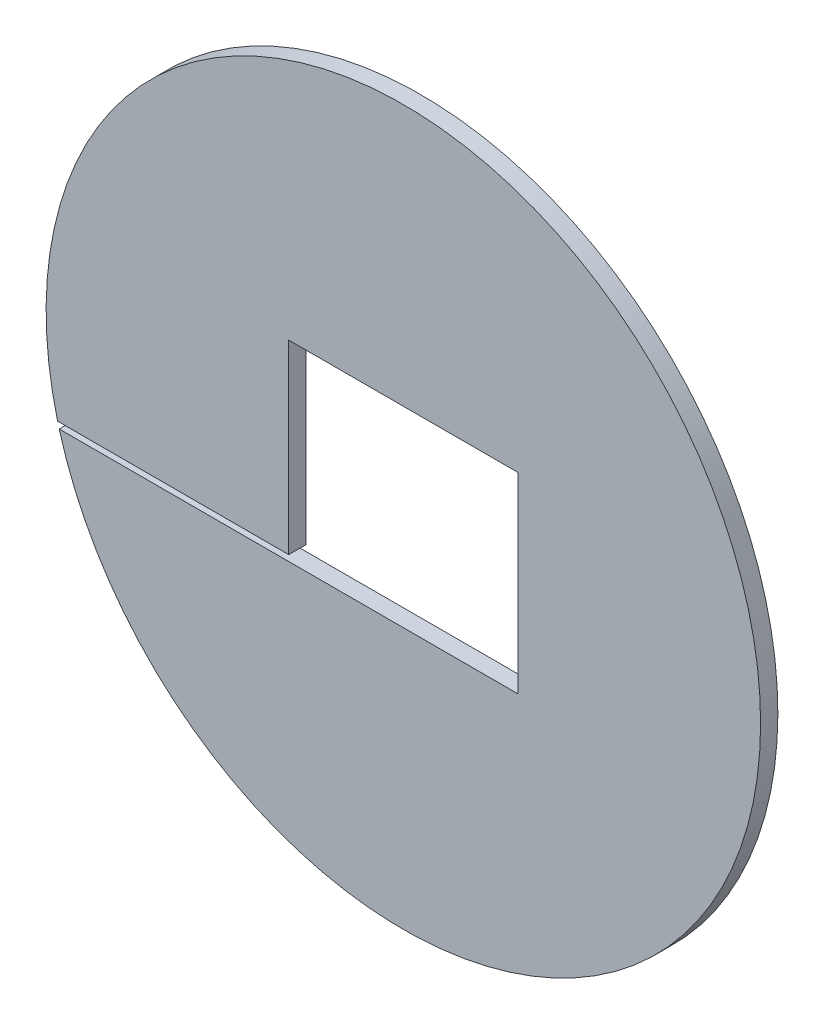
ISO-10303-21;
HEADER;
FILE_DESCRIPTION(('STEP AP214'),'2;1');
FILE_NAME('part.step','',(''),(''),'','','');
FILE_SCHEMA(('AUTOMOTIVE_DESIGN { 1 0 10303 214 1 1 1 1 }'));
ENDSEC;
DATA;
#1=APPLICATION_CONTEXT('core data for automotive mechanical design processes');
#2=APPLICATION_PROTOCOL_DEFINITION('international standard','automotive_design',2000,#1);
#3=PRODUCT_CONTEXT('',#1,'mechanical');
#4=PRODUCT('Part','Part','',(#3));
#5=PRODUCT_RELATED_PRODUCT_CATEGORY('part','',(#4));
#6=PRODUCT_DEFINITION_FORMATION('','',#4);
#7=PRODUCT_DEFINITION_CONTEXT('part definition',#1,'design');
#8=PRODUCT_DEFINITION('design','',#6,#7);
#9=PRODUCT_DEFINITION_SHAPE('','',#8);
#10=(LENGTH_UNIT() NAMED_UNIT(*) SI_UNIT(.MILLI.,.METRE.));
#11=(NAMED_UNIT(*) PLANE_ANGLE_UNIT() SI_UNIT($,.RADIAN.));
#12=(NAMED_UNIT(*) SI_UNIT($,.STERADIAN.) SOLID_ANGLE_UNIT());
#13=UNCERTAINTY_MEASURE_WITH_UNIT(LENGTH_MEASURE(1.E-05),#10,'distance_accuracy_value','');
#14=(GEOMETRIC_REPRESENTATION_CONTEXT(3) GLOBAL_UNCERTAINTY_ASSIGNED_CONTEXT((#13)) GLOBAL_UNIT_ASSIGNED_CONTEXT((#10,
#11,#12)) REPRESENTATION_CONTEXT('',''));
#15=CARTESIAN_POINT('',(0.,0.,0.));
#16=DIRECTION('',(0.,0.,1.));
#17=DIRECTION('',(1.,0.,0.));
#18=AXIS2_PLACEMENT_3D('',#15,#16,#17);
#19=CARTESIAN_POINT('',(0.,0.,0.7366));
#20=DIRECTION('',(0.,0.,-1.));
#21=DIRECTION('',(-1.,0.,0.));
#22=AXIS2_PLACEMENT_3D('',#19,#20,#21);
#23=CYLINDRICAL_SURFACE('',#22,15.24);
#24=DIRECTION('',(0.,0.,1.));
#25=VECTOR('',#24,1.);
#26=CARTESIAN_POINT('',(-14.7494849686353,-3.8354,0.7366));
#27=LINE('',#26,#25);
#28=CARTESIAN_POINT('',(-14.7494849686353,-3.8354,0.7366));
#29=VERTEX_POINT('',#28);
#30=CARTESIAN_POINT('',(-14.7494849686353,-3.8354,0.));
#31=VERTEX_POINT('',#30);
#32=EDGE_CURVE('E56',#29,#31,#27,.F.);
#33=ORIENTED_EDGE('',*,*,#32,.F.);
#34=CARTESIAN_POINT('',(0.,0.,0.7366));
#35=DIRECTION('',(0.,0.,1.));
#36=DIRECTION('',(1.,0.,0.));
#37=AXIS2_PLACEMENT_3D('',#34,#35,#36);
#38=CIRCLE('',#37,15.24);
#39=CARTESIAN_POINT('',(-14.6810901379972,-4.0894,0.7366));
#40=VERTEX_POINT('',#39);
#41=EDGE_CURVE('E11',#40,#29,#38,.T.);
#42=ORIENTED_EDGE('',*,*,#41,.F.);
#43=DIRECTION('',(0.,0.,1.));
#44=VECTOR('',#43,1.);
#45=CARTESIAN_POINT('',(-14.6810901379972,-4.0894,0.7366));
#46=LINE('',#45,#44);
#47=CARTESIAN_POINT('',(-14.6810901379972,-4.0894,0.));
#48=VERTEX_POINT('',#47);
#49=EDGE_CURVE('E93',#40,#48,#46,.F.);
#50=ORIENTED_EDGE('',*,*,#49,.T.);
#51=CARTESIAN_POINT('',(0.,0.,0.));
#52=DIRECTION('',(0.,0.,1.));
#53=DIRECTION('',(1.,0.,0.));
#54=AXIS2_PLACEMENT_3D('',#51,#52,#53);
#55=CIRCLE('',#54,15.24);
#56=EDGE_CURVE('E40',#48,#31,#55,.T.);
#57=ORIENTED_EDGE('',*,*,#56,.T.);
#58=EDGE_LOOP('',(#33,#42,#50,#57));
#59=FACE_BOUND('',#58,.T.);
#60=ADVANCED_FACE('F33',(#59),#23,.T.);
#61=CARTESIAN_POINT('',(0.,0.,0.7366));
#62=DIRECTION('',(0.,0.,1.));
#63=DIRECTION('',(1.,0.,0.));
#64=AXIS2_PLACEMENT_3D('',#61,#62,#63);
#65=PLANE('',#64);
#66=ORIENTED_EDGE('',*,*,#41,.T.);
#67=DIRECTION('',(-1.,0.,0.));
#68=VECTOR('',#67,1.);
#69=CARTESIAN_POINT('',(-4.8895,-3.8354,0.7366));
#70=LINE('',#69,#68);
#71=CARTESIAN_POINT('',(-4.8895,-3.8354,0.7366));
#72=VERTEX_POINT('',#71);
#73=EDGE_CURVE('E76',#72,#29,#70,.T.);
#74=ORIENTED_EDGE('',*,*,#73,.F.);
#75=DIRECTION('',(0.,-1.,0.));
#76=VECTOR('',#75,1.);
#77=CARTESIAN_POINT('',(-4.8895,4.0894,0.7366));
#78=LINE('',#77,#76);
#79=CARTESIAN_POINT('',(-4.8895,4.0894,0.7366));
#80=VERTEX_POINT('',#79);
#81=EDGE_CURVE('E83',#80,#72,#78,.T.);
#82=ORIENTED_EDGE('',*,*,#81,.F.);
#83=DIRECTION('',(-1.,0.,0.));
#84=VECTOR('',#83,1.);
#85=CARTESIAN_POINT('',(-4.8895,4.0894,0.7366));
#86=LINE('',#85,#84);
#87=CARTESIAN_POINT('',(4.8895,4.0894,0.7366));
#88=VERTEX_POINT('',#87);
#89=EDGE_CURVE('E139',#88,#80,#86,.T.);
#90=ORIENTED_EDGE('',*,*,#89,.F.);
#91=DIRECTION('',(0.,1.,0.));
#92=VECTOR('',#91,1.);
#93=CARTESIAN_POINT('',(4.8895,4.0894,0.7366));
#94=LINE('',#93,#92);
#95=CARTESIAN_POINT('',(4.8895,-4.0894,0.7366));
#96=VERTEX_POINT('',#95);
#97=EDGE_CURVE('E107',#96,#88,#94,.T.);
#98=ORIENTED_EDGE('',*,*,#97,.F.);
#99=DIRECTION('',(1.,0.,0.));
#100=VECTOR('',#99,1.);
#101=CARTESIAN_POINT('',(-4.8895,-4.0894,0.7366));
#102=LINE('',#101,#100);
#103=EDGE_CURVE('E96',#40,#96,#102,.T.);
#104=ORIENTED_EDGE('',*,*,#103,.F.);
#105=EDGE_LOOP('',(#66,#74,#82,#90,#98,#104));
#106=FACE_BOUND('',#105,.T.);
#107=ADVANCED_FACE('F105',(#106),#65,.T.);
#108=CARTESIAN_POINT('',(0.,0.,0.));
#109=DIRECTION('',(0.,0.,1.));
#110=DIRECTION('',(1.,0.,0.));
#111=AXIS2_PLACEMENT_3D('',#108,#109,#110);
#112=PLANE('',#111);
#113=DIRECTION('',(1.,0.,0.));
#114=VECTOR('',#113,1.);
#115=CARTESIAN_POINT('',(0.,-3.8354,0.));
#116=LINE('',#115,#114);
#117=CARTESIAN_POINT('',(-4.8895,-3.8354,0.));
#118=VERTEX_POINT('',#117);
#119=EDGE_CURVE('E101',#118,#31,#116,.F.);
#120=ORIENTED_EDGE('',*,*,#119,.T.);
#121=ORIENTED_EDGE('',*,*,#56,.F.);
#122=DIRECTION('',(1.,0.,0.));
#123=VECTOR('',#122,1.);
#124=CARTESIAN_POINT('',(0.,-4.0894,0.));
#125=LINE('',#124,#123);
#126=CARTESIAN_POINT('',(4.8895,-4.0894,0.));
#127=VERTEX_POINT('',#126);
#128=EDGE_CURVE('E71',#48,#127,#125,.T.);
#129=ORIENTED_EDGE('',*,*,#128,.T.);
#130=DIRECTION('',(0.,1.,0.));
#131=VECTOR('',#130,1.);
#132=CARTESIAN_POINT('',(4.8895,0.,0.));
#133=LINE('',#132,#131);
#134=CARTESIAN_POINT('',(4.8895,4.0894,0.));
#135=VERTEX_POINT('',#134);
#136=EDGE_CURVE('E125',#127,#135,#133,.T.);
#137=ORIENTED_EDGE('',*,*,#136,.T.);
#138=DIRECTION('',(1.,0.,0.));
#139=VECTOR('',#138,1.);
#140=CARTESIAN_POINT('',(0.,4.0894,0.));
#141=LINE('',#140,#139);
#142=CARTESIAN_POINT('',(-4.8895,4.0894,0.));
#143=VERTEX_POINT('',#142);
#144=EDGE_CURVE('E131',#135,#143,#141,.F.);
#145=ORIENTED_EDGE('',*,*,#144,.T.);
#146=DIRECTION('',(0.,1.,0.));
#147=VECTOR('',#146,1.);
#148=CARTESIAN_POINT('',(-4.8895,0.,0.));
#149=LINE('',#148,#147);
#150=EDGE_CURVE('E132',#143,#118,#149,.F.);
#151=ORIENTED_EDGE('',*,*,#150,.T.);
#152=EDGE_LOOP('',(#120,#121,#129,#137,#145,#151));
#153=FACE_BOUND('',#152,.T.);
#154=ADVANCED_FACE('F129',(#153),#112,.F.);
#155=CARTESIAN_POINT('',(4.8895,4.0894,0.7366));
#156=DIRECTION('',(1.,0.,0.));
#157=DIRECTION('',(0.,1.,0.));
#158=AXIS2_PLACEMENT_3D('',#155,#156,#157);
#159=PLANE('',#158);
#160=DIRECTION('',(0.,0.,1.));
#161=VECTOR('',#160,1.);
#162=CARTESIAN_POINT('',(4.8895,-4.0894,0.7366));
#163=LINE('',#162,#161);
#164=EDGE_CURVE('E47',#96,#127,#163,.F.);
#165=ORIENTED_EDGE('',*,*,#164,.F.);
#166=ORIENTED_EDGE('',*,*,#97,.T.);
#167=DIRECTION('',(0.,0.,1.));
#168=VECTOR('',#167,1.);
#169=CARTESIAN_POINT('',(4.8895,4.0894,0.7366));
#170=LINE('',#169,#168);
#171=EDGE_CURVE('E118',#88,#135,#170,.F.);
#172=ORIENTED_EDGE('',*,*,#171,.T.);
#173=ORIENTED_EDGE('',*,*,#136,.F.);
#174=EDGE_LOOP('',(#165,#166,#172,#173));
#175=FACE_BOUND('',#174,.T.);
#176=ADVANCED_FACE('F124',(#175),#159,.F.);
#177=CARTESIAN_POINT('',(-4.8895,4.0894,0.7366));
#178=DIRECTION('',(0.,1.,0.));
#179=DIRECTION('',(-1.,0.,0.));
#180=AXIS2_PLACEMENT_3D('',#177,#178,#179);
#181=PLANE('',#180);
#182=ORIENTED_EDGE('',*,*,#171,.F.);
#183=ORIENTED_EDGE('',*,*,#89,.T.);
#184=DIRECTION('',(0.,0.,1.));
#185=VECTOR('',#184,1.);
#186=CARTESIAN_POINT('',(-4.8895,4.0894,0.7366));
#187=LINE('',#186,#185);
#188=EDGE_CURVE('E111',#80,#143,#187,.F.);
#189=ORIENTED_EDGE('',*,*,#188,.T.);
#190=ORIENTED_EDGE('',*,*,#144,.F.);
#191=EDGE_LOOP('',(#182,#183,#189,#190));
#192=FACE_BOUND('',#191,.T.);
#193=ADVANCED_FACE('F141',(#192),#181,.F.);
#194=CARTESIAN_POINT('',(-4.8895,4.0894,0.7366));
#195=DIRECTION('',(-1.,0.,0.));
#196=DIRECTION('',(0.,-1.,0.));
#197=AXIS2_PLACEMENT_3D('',#194,#195,#196);
#198=PLANE('',#197);
#199=ORIENTED_EDGE('',*,*,#188,.F.);
#200=ORIENTED_EDGE('',*,*,#81,.T.);
#201=DIRECTION('',(0.,0.,1.));
#202=VECTOR('',#201,1.);
#203=CARTESIAN_POINT('',(-4.8895,-3.8354,0.7366));
#204=LINE('',#203,#202);
#205=EDGE_CURVE('E109',#72,#118,#204,.F.);
#206=ORIENTED_EDGE('',*,*,#205,.T.);
#207=ORIENTED_EDGE('',*,*,#150,.F.);
#208=EDGE_LOOP('',(#199,#200,#206,#207));
#209=FACE_BOUND('',#208,.T.);
#210=ADVANCED_FACE('F142',(#209),#198,.F.);
#211=CARTESIAN_POINT('',(-4.8895,-3.8354,0.7366));
#212=DIRECTION('',(0.,1.,0.));
#213=DIRECTION('',(-1.,0.,0.));
#214=AXIS2_PLACEMENT_3D('',#211,#212,#213);
#215=PLANE('',#214);
#216=ORIENTED_EDGE('',*,*,#205,.F.);
#217=ORIENTED_EDGE('',*,*,#73,.T.);
#218=ORIENTED_EDGE('',*,*,#32,.T.);
#219=ORIENTED_EDGE('',*,*,#119,.F.);
#220=EDGE_LOOP('',(#216,#217,#218,#219));
#221=FACE_BOUND('',#220,.T.);
#222=ADVANCED_FACE('F143',(#221),#215,.F.);
#223=CARTESIAN_POINT('',(-4.8895,-4.0894,0.7366));
#224=DIRECTION('',(0.,-1.,0.));
#225=DIRECTION('',(1.,0.,0.));
#226=AXIS2_PLACEMENT_3D('',#223,#224,#225);
#227=PLANE('',#226);
#228=ORIENTED_EDGE('',*,*,#103,.T.);
#229=ORIENTED_EDGE('',*,*,#164,.T.);
#230=ORIENTED_EDGE('',*,*,#128,.F.);
#231=ORIENTED_EDGE('',*,*,#49,.F.);
#232=EDGE_LOOP('',(#228,#229,#230,#231));
#233=FACE_BOUND('',#232,.T.);
#234=ADVANCED_FACE('F95',(#233),#227,.F.);
#235=CLOSED_SHELL('',(#60,#107,#154,#176,#193,#210,#222,#234));
#236=MANIFOLD_SOLID_BREP('B2',#235);
#237=ADVANCED_BREP_SHAPE_REPRESENTATION('',(#18,#236),#14);
#238=SHAPE_DEFINITION_REPRESENTATION(#9,#237);
ENDSEC;
END-ISO-10303-21;
